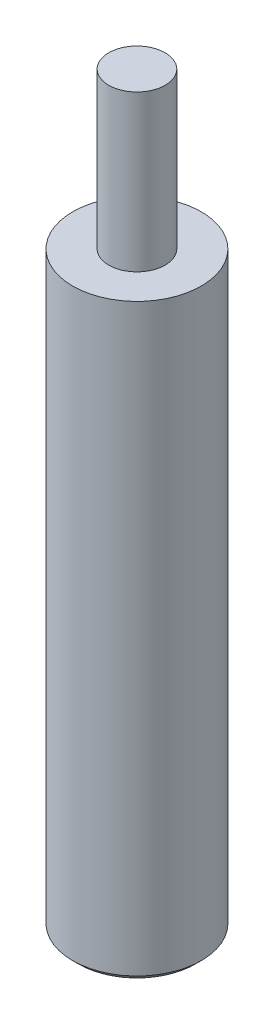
ISO-10303-21;
HEADER;
FILE_DESCRIPTION(('STEP AP214'),'2;1');
FILE_NAME('part.step','',(''),(''),'','','');
FILE_SCHEMA(('AUTOMOTIVE_DESIGN { 1 0 10303 214 1 1 1 1 }'));
ENDSEC;
DATA;
#1=APPLICATION_CONTEXT('core data for automotive mechanical design processes');
#2=APPLICATION_PROTOCOL_DEFINITION('international standard','automotive_design',2000,#1);
#3=PRODUCT_CONTEXT('',#1,'mechanical');
#4=PRODUCT('Part','Part','',(#3));
#5=PRODUCT_RELATED_PRODUCT_CATEGORY('part','',(#4));
#6=PRODUCT_DEFINITION_FORMATION('','',#4);
#7=PRODUCT_DEFINITION_CONTEXT('part definition',#1,'design');
#8=PRODUCT_DEFINITION('design','',#6,#7);
#9=PRODUCT_DEFINITION_SHAPE('','',#8);
#10=(LENGTH_UNIT() NAMED_UNIT(*) SI_UNIT(.MILLI.,.METRE.));
#11=(NAMED_UNIT(*) PLANE_ANGLE_UNIT() SI_UNIT($,.RADIAN.));
#12=(NAMED_UNIT(*) SI_UNIT($,.STERADIAN.) SOLID_ANGLE_UNIT());
#13=UNCERTAINTY_MEASURE_WITH_UNIT(LENGTH_MEASURE(1.E-05),#10,'distance_accuracy_value','');
#14=(GEOMETRIC_REPRESENTATION_CONTEXT(3) GLOBAL_UNCERTAINTY_ASSIGNED_CONTEXT((#13)) GLOBAL_UNIT_ASSIGNED_CONTEXT((#10,
#11,#12)) REPRESENTATION_CONTEXT('',''));
#15=CARTESIAN_POINT('',(0.,0.,0.));
#16=DIRECTION('',(0.,0.,1.));
#17=DIRECTION('',(1.,0.,0.));
#18=AXIS2_PLACEMENT_3D('',#15,#16,#17);
#19=CARTESIAN_POINT('',(0.,50.8,0.));
#20=DIRECTION('',(0.,1.,0.));
#21=DIRECTION('',(0.,0.,1.));
#22=AXIS2_PLACEMENT_3D('',#19,#20,#21);
#23=PLANE('',#22);
#24=CARTESIAN_POINT('',(0.,50.8,0.));
#25=DIRECTION('',(0.,1.,0.));
#26=DIRECTION('',(0.,0.,1.));
#27=AXIS2_PLACEMENT_3D('',#24,#25,#26);
#28=CIRCLE('',#27,5.5372);
#29=CARTESIAN_POINT('',(0.,50.8,5.5372));
#30=VERTEX_POINT('',#29);
#31=EDGE_CURVE('E44',#30,#30,#28,.T.);
#32=ORIENTED_EDGE('',*,*,#31,.T.);
#33=EDGE_LOOP('',(#32));
#34=FACE_BOUND('',#33,.T.);
#35=CARTESIAN_POINT('',(0.,50.8,0.));
#36=DIRECTION('',(0.,1.,0.));
#37=DIRECTION('',(0.,0.,1.));
#38=AXIS2_PLACEMENT_3D('',#35,#36,#37);
#39=CIRCLE('',#38,2.4257);
#40=CARTESIAN_POINT('',(0.,50.8,2.4257));
#41=VERTEX_POINT('',#40);
#42=EDGE_CURVE('E51',#41,#41,#39,.T.);
#43=ORIENTED_EDGE('',*,*,#42,.F.);
#44=EDGE_LOOP('',(#43));
#45=FACE_BOUND('',#44,.T.);
#46=ADVANCED_FACE('F33',(#34,#45),#23,.T.);
#47=CARTESIAN_POINT('',(0.,50.8,0.));
#48=DIRECTION('',(0.,-1.,0.));
#49=DIRECTION('',(0.,0.,-1.));
#50=AXIS2_PLACEMENT_3D('',#47,#48,#49);
#51=CYLINDRICAL_SURFACE('',#50,5.5372);
#52=CARTESIAN_POINT('',(0.,0.508000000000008,0.));
#53=DIRECTION('',(0.,1.,0.));
#54=DIRECTION('',(0.,0.,1.));
#55=AXIS2_PLACEMENT_3D('',#52,#53,#54);
#56=CIRCLE('',#55,5.5372);
#57=CARTESIAN_POINT('',(0.,0.508000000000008,5.5372));
#58=VERTEX_POINT('',#57);
#59=EDGE_CURVE('E40',#58,#58,#56,.T.);
#60=ORIENTED_EDGE('',*,*,#59,.T.);
#61=EDGE_LOOP('',(#60));
#62=FACE_BOUND('',#61,.T.);
#63=ORIENTED_EDGE('',*,*,#31,.F.);
#64=EDGE_LOOP('',(#63));
#65=FACE_BOUND('',#64,.T.);
#66=ADVANCED_FACE('F67',(#62,#65),#51,.T.);
#67=CARTESIAN_POINT('',(0.,0.,0.));
#68=DIRECTION('',(0.,1.,0.));
#69=DIRECTION('',(0.,0.,1.));
#70=AXIS2_PLACEMENT_3D('',#67,#68,#69);
#71=PLANE('',#70);
#72=CARTESIAN_POINT('',(0.,0.,0.));
#73=DIRECTION('',(0.,1.,0.));
#74=DIRECTION('',(0.,0.,1.));
#75=AXIS2_PLACEMENT_3D('',#72,#73,#74);
#76=CIRCLE('',#75,5.02919999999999);
#77=CARTESIAN_POINT('',(0.,0.,5.02919999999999));
#78=VERTEX_POINT('',#77);
#79=EDGE_CURVE('E10',#78,#78,#76,.F.);
#80=ORIENTED_EDGE('',*,*,#79,.T.);
#81=EDGE_LOOP('',(#80));
#82=FACE_BOUND('',#81,.T.);
#83=ADVANCED_FACE('F62',(#82),#71,.F.);
#84=CARTESIAN_POINT('',(0.,64.2112,0.));
#85=DIRECTION('',(0.,-1.,0.));
#86=DIRECTION('',(0.,0.,-1.));
#87=AXIS2_PLACEMENT_3D('',#84,#85,#86);
#88=CYLINDRICAL_SURFACE('',#87,2.4257);
#89=CARTESIAN_POINT('',(0.,64.2112,0.));
#90=DIRECTION('',(0.,1.,0.));
#91=DIRECTION('',(0.,0.,1.));
#92=AXIS2_PLACEMENT_3D('',#89,#90,#91);
#93=CIRCLE('',#92,2.4257);
#94=CARTESIAN_POINT('',(0.,64.2112,2.4257));
#95=VERTEX_POINT('',#94);
#96=EDGE_CURVE('E48',#95,#95,#93,.T.);
#97=ORIENTED_EDGE('',*,*,#96,.F.);
#98=EDGE_LOOP('',(#97));
#99=FACE_BOUND('',#98,.T.);
#100=ORIENTED_EDGE('',*,*,#42,.T.);
#101=EDGE_LOOP('',(#100));
#102=FACE_BOUND('',#101,.T.);
#103=ADVANCED_FACE('F59',(#99,#102),#88,.T.);
#104=CARTESIAN_POINT('',(0.,64.2112,0.));
#105=DIRECTION('',(0.,1.,0.));
#106=DIRECTION('',(0.,0.,1.));
#107=AXIS2_PLACEMENT_3D('',#104,#105,#106);
#108=PLANE('',#107);
#109=ORIENTED_EDGE('',*,*,#96,.T.);
#110=EDGE_LOOP('',(#109));
#111=FACE_BOUND('',#110,.T.);
#112=ADVANCED_FACE('F57',(#111),#108,.T.);
#113=CARTESIAN_POINT('',(0.,0.508000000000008,0.));
#114=DIRECTION('',(0.,1.,0.));
#115=DIRECTION('',(0.,0.,1.));
#116=AXIS2_PLACEMENT_3D('',#113,#114,#115);
#117=CONICAL_SURFACE('',#116,5.5372,0.78539816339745);
#118=ORIENTED_EDGE('',*,*,#79,.F.);
#119=EDGE_LOOP('',(#118));
#120=FACE_BOUND('',#119,.T.);
#121=ORIENTED_EDGE('',*,*,#59,.F.);
#122=EDGE_LOOP('',(#121));
#123=FACE_BOUND('',#122,.T.);
#124=ADVANCED_FACE('F35',(#120,#123),#117,.T.);
#125=CLOSED_SHELL('',(#46,#66,#83,#103,#112,#124));
#126=MANIFOLD_SOLID_BREP('B2',#125);
#127=ADVANCED_BREP_SHAPE_REPRESENTATION('',(#18,#126),#14);
#128=SHAPE_DEFINITION_REPRESENTATION(#9,#127);
ENDSEC;
END-ISO-10303-21;
